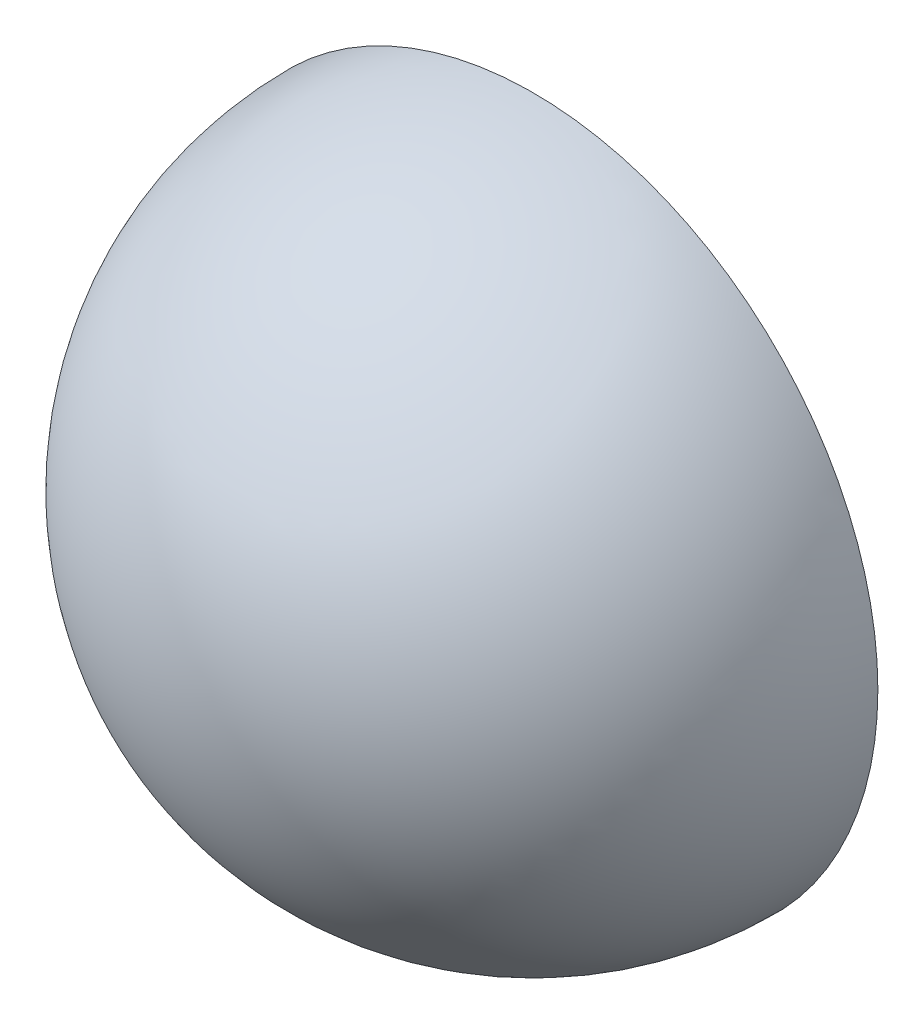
from build123d import *

# Parameters (mm, degrees)
REVOLVE1_ANGLE     = 180
SKETCH2_R          = 1
CUT_EXTRUDE1_DEPTH = 0.5


with BuildPart() as part:
    # Sketch1 → Revolve1 (revolve)
    with BuildSketch(Plane.XY):
        with BuildLine():
            Line((1.25, 0), (-1.25, 0))
            ThreePointArc((-1.25, 0), (0, 1.25), (1.25, 0))
        make_face()
    revolve(axis=Axis((0, 0, 0), (1, 0, 0)), revolution_arc=REVOLVE1_ANGLE)

    # Sketch2 → Cut-Extrude1 (cut)
    with BuildSketch(Plane(origin=(0, 0, 0), x_dir=(-1, 0, 0), z_dir=(0, 0, -1))):
        with Locations(Location((0, 0, 0), (0, 0, 90))):
            Circle(SKETCH2_R)
    extrude(amount=-CUT_EXTRUDE1_DEPTH, mode=Mode.SUBTRACT)


solid = part.part
